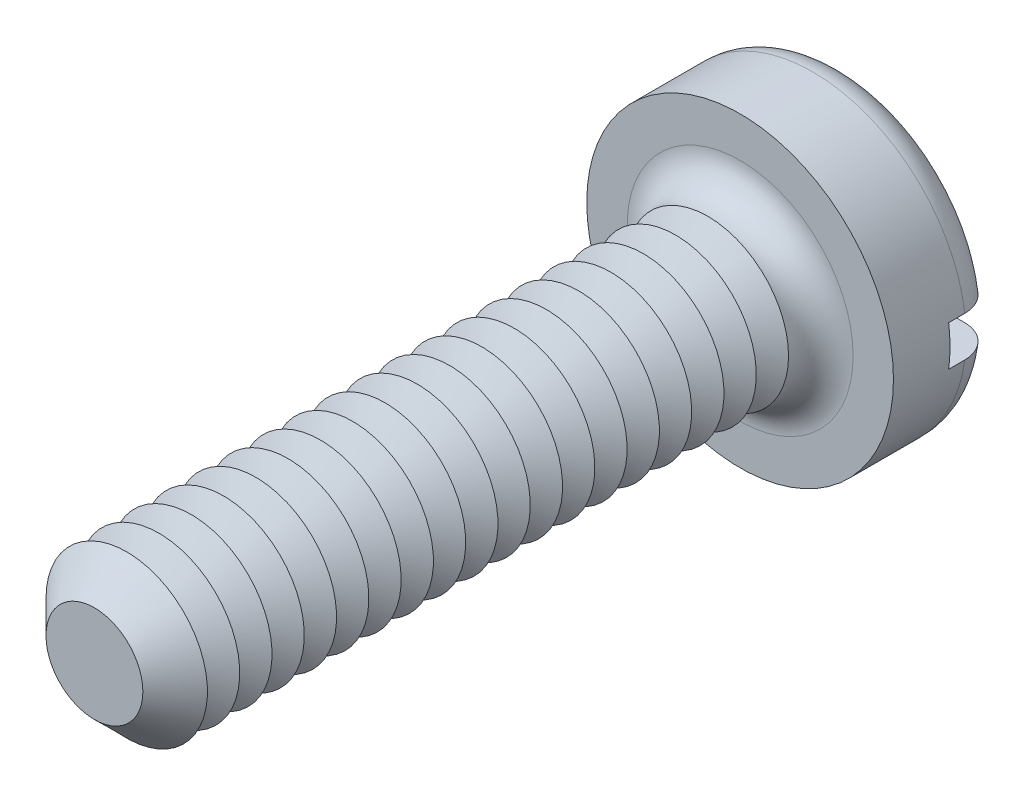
from build123d import *

# Parameters (mm, degrees)
SKETCH3_R           = 1.9
BOSS_EXTRUDE2_DEPTH = 1.3
SKETCH4_R           = 1
BOSS_EXTRUDE3_DEPTH = 8
FILLET1_R           = 0.4
CHAMFER1_SIZE       = 0.4
LPATTERN1_COUNT     = 18
LPATTERN1_PITCH     = 0.4
SKETCH8_W           = 3.8
SKETCH8_H           = 0.5
CUT_EXTRUDE1_DEPTH  = 0.6


with BuildPart() as part:
    # Sketch3 → Boss-Extrude2 (new body)
    with BuildSketch(Plane.XY):
        Circle(SKETCH3_R)
    extrude(amount=-BOSS_EXTRUDE2_DEPTH)

    # Sketch4 → Boss-Extrude3 (add)
    with BuildSketch(Plane.XY):
        Circle(SKETCH4_R)
    extrude(amount=BOSS_EXTRUDE3_DEPTH)

    # Fillet1
    fillet1_edges = [part.edges().sort_by_distance(p)[0] for p in [
        (-1.9, 0, -1.3),
        (-1, 0, 0),
    ]]
    fillet(fillet1_edges, radius=FILLET1_R)

    # Chamfer1
    chamfer1_edges = [part.edges().sort_by_distance(p)[0] for p in [
        (-1, 0, 8),
    ]]
    chamfer(chamfer1_edges, length=CHAMFER1_SIZE)

    # Sketch6 → Cut-Revolve1 (revolve, cut)
    with BuildSketch(Plane(origin=(0, 0, 0), x_dir=(0, 0, -1), z_dir=(1, 0, 0)), mode=Mode.PRIVATE) as cut_revolve1_sk:
        Polygon((-0.4, 1), (-0.6, 0.653589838), (-0.8, 1), align=None)
    cut_revolve1 = revolve(cut_revolve1_sk.sketch.rotate(Axis((0, 0, -1.694361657), (0, 0, 1)), 90), axis=Axis((0, 0, -1.694361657), (0, 0, 1)), mode=Mode.SUBTRACT)

    # LPattern1: Cut-Revolve1 ×18
    with Locations(*[(0, 0, i * LPATTERN1_PITCH) for i in range(1, LPATTERN1_COUNT)]):
        add(cut_revolve1, mode=Mode.SUBTRACT)

    # Sketch8 → Cut-Extrude1 (cut)
    with BuildSketch(Plane(origin=(0, 0, -1.3), x_dir=(-1, 0, 0), z_dir=(0, 0, -1))):
        Rectangle(SKETCH8_W, SKETCH8_H)
    extrude(amount=-CUT_EXTRUDE1_DEPTH, mode=Mode.SUBTRACT)


solid = part.part
